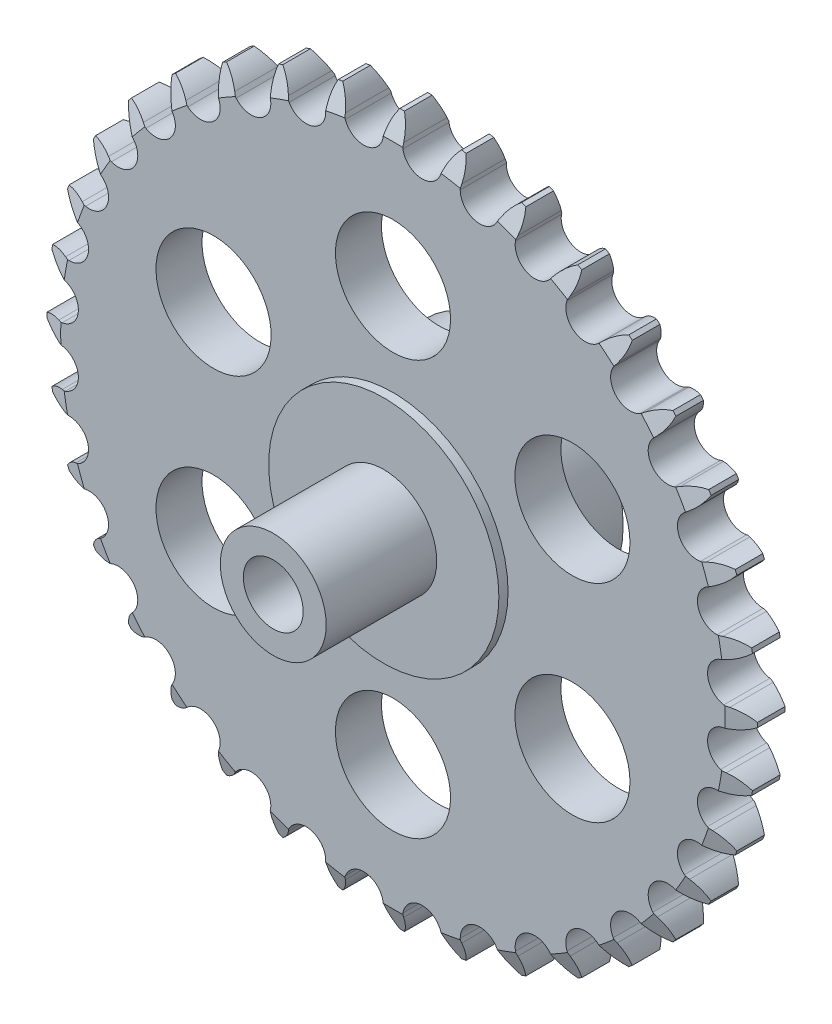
from build123d import *

# Parameters (mm, degrees)
SKETCH2_R                       = 68.60307911
BOSS_EXTRUDE1_DEPTH             = 5
BOSS_EXTRUDE2_REACH             = 99.148
BOSS_EXTRUDE2_DIRECTION_2_REACH = 99.148
CIRPATTERN1_COUNT               = 36
BOSS_EXTRUDE3_DEPTH             = 7
BOSS_EXTRUDE3_DEPTH_BACK        = 20
SKETCH6_R                       = 25
CUT_EXTRUDE1_DEPTH              = 111.942596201
CUT_EXTRUDE1_DEPTH_BACK         = 111.942596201
SKETCH7_R                       = 6.5
SKETCH8_R                       = 11.5
SKETCH8_R_2                     = 6.5
BOSS_EXTRUDE4_DEPTH             = 24
SKETCH9_R                       = 12.5
CUT_EXTRUDE2_DEPTH              = 113.179586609
CIRPATTERN2_COUNT               = 6


with BuildPart() as part:
    # Sketch2 → Boss-Extrude1 (new, symmetric)
    with BuildSketch(Plane.XY):
        Circle(SKETCH2_R)
    extrude(amount=BOSS_EXTRUDE1_DEPTH, both=True)

    # Boss-Extrude2: up to this face of the body (flat: up to its plane)
    boss_extrude2_end = Plane(part.part.faces().sort_by_distance((0, 0, 5))[0])
    # Sketch4 → Boss-Extrude2 (add, up to the picked face)
    with BuildSketch(Plane.XY, mode=Mode.PRIVATE) as boss_extrude2_sk1:
        with BuildLine():
            Line((-0.5, 77.163008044), (0.5, 77.163008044))
            ThreePointArc((0.5, 77.163008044), (1.520836, 75.099924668), (2.042896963, 72.85807911))
            Line((2.042896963, 72.85807911), (2.156832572, 71.85807911))
            ThreePointArc((2.156832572, 71.85807911), (3.469336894, 69.449250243), (5.979152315, 68.342023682))
            ThreePointArc((5.979152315, 68.342023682), (0, 68.60307911), (-5.979152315, 68.342023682))
            ThreePointArc((-5.979152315, 68.342023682), (-3.469336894, 69.449250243), (-2.156832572, 71.85807911))
            Line((-2.156832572, 71.85807911), (-2.042896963, 72.85807911))
            ThreePointArc((-2.042896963, 72.85807911), (-1.520836, 75.099924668), (-0.5, 77.163008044))
        make_face()
    boss_extrude2_tool1 = split(extrude(boss_extrude2_sk1.sketch, amount=BOSS_EXTRUDE2_REACH, mode=Mode.PRIVATE), bisect_by=boss_extrude2_end, keep=Keep.BOTH, mode=Mode.PRIVATE)
    boss_extrude2 = boss_extrude2_tool1.solids().sort_by(Axis((0, 71.819777, 0), (0, 0, 1)))[0]
    add(boss_extrude2)

    # Boss-Extrude2 direction 2: up to this face of the body (flat: up to its plane)
    boss_extrude2_direction_2_end = Plane(part.part.faces().sort_by_distance((0, 0, -5))[0])
    # Sketch4 → Boss-Extrude2 direction 2 (add, up to the picked face)
    with BuildSketch(Plane.XY, mode=Mode.PRIVATE) as boss_extrude2_direction_2_sk1:
        with BuildLine():
            Line((-0.5, 77.163008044), (0.5, 77.163008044))
            ThreePointArc((0.5, 77.163008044), (1.520836, 75.099924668), (2.042896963, 72.85807911))
            Line((2.042896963, 72.85807911), (2.156832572, 71.85807911))
            ThreePointArc((2.156832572, 71.85807911), (3.469336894, 69.449250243), (5.979152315, 68.342023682))
            ThreePointArc((5.979152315, 68.342023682), (0, 68.60307911), (-5.979152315, 68.342023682))
            ThreePointArc((-5.979152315, 68.342023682), (-3.469336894, 69.449250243), (-2.156832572, 71.85807911))
            Line((-2.156832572, 71.85807911), (-2.042896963, 72.85807911))
            ThreePointArc((-2.042896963, 72.85807911), (-1.520836, 75.099924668), (-0.5, 77.163008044))
        make_face()
    boss_extrude2_direction_2_tool1 = split(extrude(boss_extrude2_direction_2_sk1.sketch, amount=-BOSS_EXTRUDE2_DIRECTION_2_REACH, mode=Mode.PRIVATE), bisect_by=boss_extrude2_direction_2_end, keep=Keep.BOTH, mode=Mode.PRIVATE)
    boss_extrude2_direction_2 = boss_extrude2_direction_2_tool1.solids().sort_by(Axis((0, 71.819777, 0), (0, 0, -1)))[0]
    add(boss_extrude2_direction_2)

    # CirPattern1: Boss-Extrude2, Boss-Extrude2 direction 2 ×36 about axis
    cirpattern1_axis = Axis((0, 0, 0), (0, 0, 1))
    add([boss_extrude2.rotate(cirpattern1_axis, i * 360 / CIRPATTERN1_COUNT) for i in range(1, CIRPATTERN1_COUNT)])
    add([boss_extrude2_direction_2.rotate(cirpattern1_axis, i * 360 / CIRPATTERN1_COUNT) for i in range(1, CIRPATTERN1_COUNT)])

    # Sketch5 → Cut-Revolve7 (revolve, cut)
    with BuildSketch(Plane(origin=(0, 0, 0), x_dir=(0, 0, -1), z_dir=(1, 0, 0))):
        Polygon((0, 84.663008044), (-6, 84.663008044), (-6, 69.663008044), align=None)
        Polygon((6, 84.663008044), (0, 84.663008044), (6, 69.663008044), align=None)
    revolve(axis=Axis((0, 0, 0), (0, 0, 1)), mode=Mode.SUBTRACT)

    # Sketch6 → Boss-Extrude3 (add, two sides: drawn at the far end of the back side and taken through both)
    with BuildSketch(Plane.XY.offset(-BOSS_EXTRUDE3_DEPTH_BACK)):
        Circle(SKETCH6_R)
    extrude(amount=BOSS_EXTRUDE3_DEPTH + BOSS_EXTRUDE3_DEPTH_BACK)

    # Sketch7 → Cut-Extrude1 (cut, two sides: drawn at the far end of the back side and taken through both)
    with BuildSketch(Plane.XY.offset(-CUT_EXTRUDE1_DEPTH_BACK)):
        Circle(SKETCH7_R)
    extrude(amount=CUT_EXTRUDE1_DEPTH + CUT_EXTRUDE1_DEPTH_BACK, mode=Mode.SUBTRACT)

    # Sketch8 → Boss-Extrude4 (add)
    with BuildSketch(Plane.XY.offset(7)):
        Circle(SKETCH8_R)
        Circle(SKETCH8_R_2, mode=Mode.SUBTRACT)
    extrude(amount=BOSS_EXTRUDE4_DEPTH)

    # Sketch9 → Cut-Extrude2 (cut, through all)
    with BuildSketch(Plane.XY.offset(5)):
        with Locations((0, 45)):
            Circle(SKETCH9_R)
    cut_extrude2 = extrude(amount=-CUT_EXTRUDE2_DEPTH, mode=Mode.SUBTRACT)

    # CirPattern2: Cut-Extrude2 ×6 about axis
    cirpattern2_axis = Axis((0, 0, 0), (0, 0, 1))
    for i in range(1, CIRPATTERN2_COUNT):
        add(cut_extrude2.rotate(cirpattern2_axis, i * 360 / CIRPATTERN2_COUNT), mode=Mode.SUBTRACT)


solid = part.part
